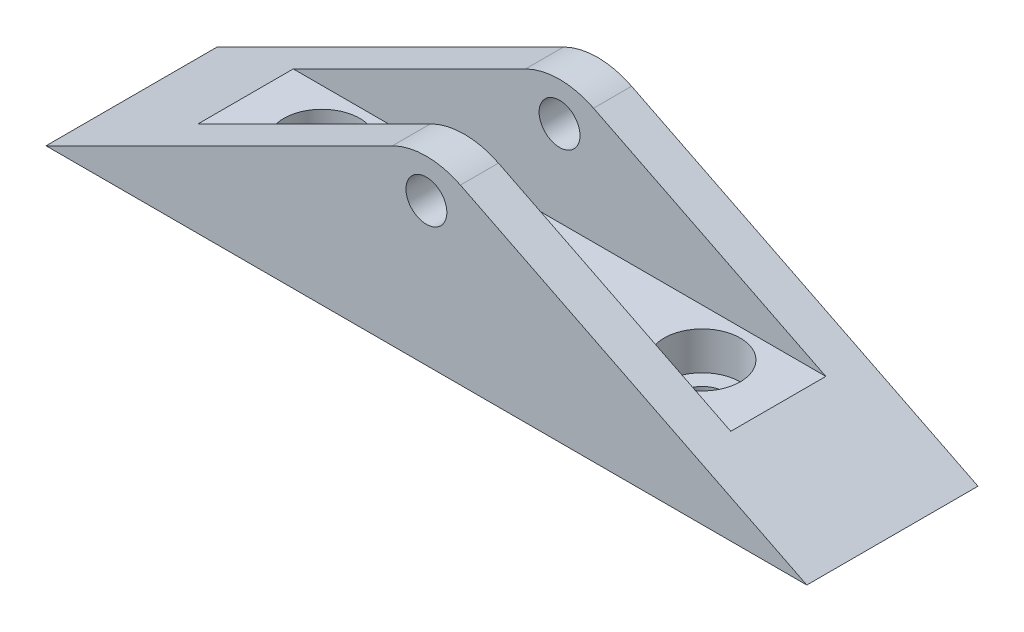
ISO-10303-21;
HEADER;
FILE_DESCRIPTION(('STEP AP214'),'2;1');
FILE_NAME('part.step','',(''),(''),'','','');
FILE_SCHEMA(('AUTOMOTIVE_DESIGN { 1 0 10303 214 1 1 1 1 }'));
ENDSEC;
DATA;
#1=APPLICATION_CONTEXT('core data for automotive mechanical design processes');
#2=APPLICATION_PROTOCOL_DEFINITION('international standard','automotive_design',2000,#1);
#3=PRODUCT_CONTEXT('',#1,'mechanical');
#4=PRODUCT('Part','Part','',(#3));
#5=PRODUCT_RELATED_PRODUCT_CATEGORY('part','',(#4));
#6=PRODUCT_DEFINITION_FORMATION('','',#4);
#7=PRODUCT_DEFINITION_CONTEXT('part definition',#1,'design');
#8=PRODUCT_DEFINITION('design','',#6,#7);
#9=PRODUCT_DEFINITION_SHAPE('','',#8);
#10=(LENGTH_UNIT() NAMED_UNIT(*) SI_UNIT(.MILLI.,.METRE.));
#11=(NAMED_UNIT(*) PLANE_ANGLE_UNIT() SI_UNIT($,.RADIAN.));
#12=(NAMED_UNIT(*) SI_UNIT($,.STERADIAN.) SOLID_ANGLE_UNIT());
#13=UNCERTAINTY_MEASURE_WITH_UNIT(LENGTH_MEASURE(1.E-05),#10,'distance_accuracy_value','');
#14=(GEOMETRIC_REPRESENTATION_CONTEXT(3) GLOBAL_UNCERTAINTY_ASSIGNED_CONTEXT((#13)) GLOBAL_UNIT_ASSIGNED_CONTEXT((#10,
#11,#12)) REPRESENTATION_CONTEXT('',''));
#15=CARTESIAN_POINT('',(0.,0.,0.));
#16=DIRECTION('',(0.,0.,1.));
#17=DIRECTION('',(1.,0.,0.));
#18=AXIS2_PLACEMENT_3D('',#15,#16,#17);
#19=CARTESIAN_POINT('',(-8.,16.,4.));
#20=DIRECTION('',(-0.447213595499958,0.894427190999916,0.));
#21=DIRECTION('',(-0.894427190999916,-0.447213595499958,0.));
#22=AXIS2_PLACEMENT_3D('',#19,#20,#21);
#23=PLANE('',#22);
#24=DIRECTION('',(0.894427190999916,0.447213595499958,0.));
#25=VECTOR('',#24,1.);
#26=CARTESIAN_POINT('',(-8.,16.,4.));
#27=LINE('',#26,#25);
#28=CARTESIAN_POINT('',(-28.,5.99999999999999,4.));
#29=VERTEX_POINT('',#28);
#30=CARTESIAN_POINT('',(-3.57770876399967,18.2111456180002,4.));
#31=VERTEX_POINT('',#30);
#32=EDGE_CURVE('E168',#29,#31,#27,.T.);
#33=ORIENTED_EDGE('',*,*,#32,.T.);
#34=DIRECTION('',(0.,0.,-1.));
#35=VECTOR('',#34,1.);
#36=CARTESIAN_POINT('',(-3.57770876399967,18.2111456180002,4.));
#37=LINE('',#36,#35);
#38=CARTESIAN_POINT('',(-3.57770876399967,18.2111456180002,0.));
#39=VERTEX_POINT('',#38);
#40=EDGE_CURVE('E186',#31,#39,#37,.T.);
#41=ORIENTED_EDGE('',*,*,#40,.T.);
#42=DIRECTION('',(0.894427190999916,0.447213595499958,0.));
#43=VECTOR('',#42,1.);
#44=CARTESIAN_POINT('',(-8.,16.,0.));
#45=LINE('',#44,#43);
#46=CARTESIAN_POINT('',(-40.,0.,0.));
#47=VERTEX_POINT('',#46);
#48=EDGE_CURVE('E129',#47,#39,#45,.T.);
#49=ORIENTED_EDGE('',*,*,#48,.F.);
#50=DIRECTION('',(0.,0.,-1.));
#51=VECTOR('',#50,1.);
#52=CARTESIAN_POINT('',(-40.,0.,104.224684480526));
#53=LINE('',#52,#51);
#54=CARTESIAN_POINT('',(-40.,0.,18.));
#55=VERTEX_POINT('',#54);
#56=EDGE_CURVE('E125',#55,#47,#53,.T.);
#57=ORIENTED_EDGE('',*,*,#56,.F.);
#58=DIRECTION('',(-0.894427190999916,-0.447213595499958,0.));
#59=VECTOR('',#58,1.);
#60=CARTESIAN_POINT('',(-8.00000000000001,16.,18.));
#61=LINE('',#60,#59);
#62=CARTESIAN_POINT('',(-3.57770876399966,18.2111456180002,18.));
#63=VERTEX_POINT('',#62);
#64=EDGE_CURVE('E112',#63,#55,#61,.T.);
#65=ORIENTED_EDGE('',*,*,#64,.F.);
#66=DIRECTION('',(0.,0.,-1.));
#67=VECTOR('',#66,1.);
#68=CARTESIAN_POINT('',(-3.57770876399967,18.2111456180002,4.));
#69=LINE('',#68,#67);
#70=CARTESIAN_POINT('',(-3.57770876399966,18.2111456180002,14.));
#71=VERTEX_POINT('',#70);
#72=EDGE_CURVE('E179',#63,#71,#69,.T.);
#73=ORIENTED_EDGE('',*,*,#72,.T.);
#74=DIRECTION('',(-0.894427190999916,-0.447213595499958,0.));
#75=VECTOR('',#74,1.);
#76=CARTESIAN_POINT('',(-8.00000000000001,16.,14.));
#77=LINE('',#76,#75);
#78=CARTESIAN_POINT('',(-28.,5.99999999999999,14.));
#79=VERTEX_POINT('',#78);
#80=EDGE_CURVE('E147',#71,#79,#77,.T.);
#81=ORIENTED_EDGE('',*,*,#80,.T.);
#82=DIRECTION('',(0.,0.,-1.));
#83=VECTOR('',#82,1.);
#84=CARTESIAN_POINT('',(-28.,5.99999999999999,104.224684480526));
#85=LINE('',#84,#83);
#86=EDGE_CURVE('E134',#79,#29,#85,.T.);
#87=ORIENTED_EDGE('',*,*,#86,.T.);
#88=EDGE_LOOP('',(#33,#41,#49,#57,#65,#73,#81,#87));
#89=FACE_BOUND('',#88,.T.);
#90=ADVANCED_FACE('F47',(#89),#23,.T.);
#91=CARTESIAN_POINT('',(8.,16.,4.));
#92=DIRECTION('',(0.447213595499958,0.894427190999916,0.));
#93=DIRECTION('',(-0.894427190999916,0.447213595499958,0.));
#94=AXIS2_PLACEMENT_3D('',#91,#92,#93);
#95=PLANE('',#94);
#96=DIRECTION('',(0.894427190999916,-0.447213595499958,0.));
#97=VECTOR('',#96,1.);
#98=CARTESIAN_POINT('',(8.,16.,0.));
#99=LINE('',#98,#97);
#100=CARTESIAN_POINT('',(3.57770876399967,18.2111456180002,0.));
#101=VERTEX_POINT('',#100);
#102=CARTESIAN_POINT('',(40.,0.,0.));
#103=VERTEX_POINT('',#102);
#104=EDGE_CURVE('E172',#101,#103,#99,.T.);
#105=ORIENTED_EDGE('',*,*,#104,.F.);
#106=DIRECTION('',(0.,0.,-1.));
#107=VECTOR('',#106,1.);
#108=CARTESIAN_POINT('',(3.57770876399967,18.2111456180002,4.));
#109=LINE('',#108,#107);
#110=CARTESIAN_POINT('',(3.57770876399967,18.2111456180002,4.));
#111=VERTEX_POINT('',#110);
#112=EDGE_CURVE('E194',#101,#111,#109,.F.);
#113=ORIENTED_EDGE('',*,*,#112,.T.);
#114=DIRECTION('',(0.894427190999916,-0.447213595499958,0.));
#115=VECTOR('',#114,1.);
#116=CARTESIAN_POINT('',(8.,16.,4.));
#117=LINE('',#116,#115);
#118=CARTESIAN_POINT('',(28.,5.99999999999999,4.));
#119=VERTEX_POINT('',#118);
#120=EDGE_CURVE('E176',#111,#119,#117,.T.);
#121=ORIENTED_EDGE('',*,*,#120,.T.);
#122=DIRECTION('',(0.,0.,-1.));
#123=VECTOR('',#122,1.);
#124=CARTESIAN_POINT('',(28.,5.99999999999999,104.224684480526));
#125=LINE('',#124,#123);
#126=CARTESIAN_POINT('',(28.,5.99999999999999,14.));
#127=VERTEX_POINT('',#126);
#128=EDGE_CURVE('E159',#127,#119,#125,.T.);
#129=ORIENTED_EDGE('',*,*,#128,.F.);
#130=DIRECTION('',(-0.894427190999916,0.447213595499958,0.));
#131=VECTOR('',#130,1.);
#132=CARTESIAN_POINT('',(8.00000000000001,16.,14.));
#133=LINE('',#132,#131);
#134=CARTESIAN_POINT('',(3.57770876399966,18.2111456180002,14.));
#135=VERTEX_POINT('',#134);
#136=EDGE_CURVE('E122',#127,#135,#133,.T.);
#137=ORIENTED_EDGE('',*,*,#136,.T.);
#138=DIRECTION('',(0.,0.,-1.));
#139=VECTOR('',#138,1.);
#140=CARTESIAN_POINT('',(3.57770876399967,18.2111456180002,4.));
#141=LINE('',#140,#139);
#142=CARTESIAN_POINT('',(3.57770876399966,18.2111456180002,18.));
#143=VERTEX_POINT('',#142);
#144=EDGE_CURVE('E63',#135,#143,#141,.F.);
#145=ORIENTED_EDGE('',*,*,#144,.T.);
#146=DIRECTION('',(-0.894427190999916,0.447213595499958,0.));
#147=VECTOR('',#146,1.);
#148=CARTESIAN_POINT('',(8.00000000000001,16.,18.));
#149=LINE('',#148,#147);
#150=CARTESIAN_POINT('',(40.,0.,18.));
#151=VERTEX_POINT('',#150);
#152=EDGE_CURVE('E140',#151,#143,#149,.T.);
#153=ORIENTED_EDGE('',*,*,#152,.F.);
#154=DIRECTION('',(0.,0.,-1.));
#155=VECTOR('',#154,1.);
#156=CARTESIAN_POINT('',(40.,0.,104.224684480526));
#157=LINE('',#156,#155);
#158=EDGE_CURVE('E135',#151,#103,#157,.T.);
#159=ORIENTED_EDGE('',*,*,#158,.T.);
#160=EDGE_LOOP('',(#105,#113,#121,#129,#137,#145,#153,#159));
#161=FACE_BOUND('',#160,.T.);
#162=ADVANCED_FACE('F213',(#161),#95,.T.);
#163=CARTESIAN_POINT('',(0.,0.,4.));
#164=DIRECTION('',(0.,0.,1.));
#165=DIRECTION('',(1.,0.,0.));
#166=AXIS2_PLACEMENT_3D('',#163,#164,#165);
#167=PLANE('',#166);
#168=CARTESIAN_POINT('',(0.,15.,4.));
#169=DIRECTION('',(0.,0.,1.));
#170=DIRECTION('',(1.,0.,0.));
#171=AXIS2_PLACEMENT_3D('',#168,#169,#170);
#172=CIRCLE('',#171,2.15);
#173=CARTESIAN_POINT('',(2.15,15.,4.));
#174=VERTEX_POINT('',#173);
#175=EDGE_CURVE('E150',#174,#174,#172,.T.);
#176=ORIENTED_EDGE('',*,*,#175,.F.);
#177=EDGE_LOOP('',(#176));
#178=FACE_BOUND('',#177,.T.);
#179=ORIENTED_EDGE('',*,*,#120,.F.);
#180=CARTESIAN_POINT('',(0.,11.0557280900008,4.));
#181=DIRECTION('',(0.,0.,1.));
#182=DIRECTION('',(1.,0.,0.));
#183=AXIS2_PLACEMENT_3D('',#180,#181,#182);
#184=CIRCLE('',#183,8.);
#185=EDGE_CURVE('E197',#111,#31,#184,.T.);
#186=ORIENTED_EDGE('',*,*,#185,.T.);
#187=ORIENTED_EDGE('',*,*,#32,.F.);
#188=DIRECTION('',(1.,0.,0.));
#189=VECTOR('',#188,1.);
#190=CARTESIAN_POINT('',(0.,5.99999999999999,4.));
#191=LINE('',#190,#189);
#192=EDGE_CURVE('E171',#29,#119,#191,.T.);
#193=ORIENTED_EDGE('',*,*,#192,.T.);
#194=EDGE_LOOP('',(#179,#186,#187,#193));
#195=FACE_BOUND('',#194,.T.);
#196=ADVANCED_FACE('F204',(#178,#195),#167,.T.);
#197=CARTESIAN_POINT('',(0.,0.,0.));
#198=DIRECTION('',(0.,0.,1.));
#199=DIRECTION('',(1.,0.,0.));
#200=AXIS2_PLACEMENT_3D('',#197,#198,#199);
#201=PLANE('',#200);
#202=CARTESIAN_POINT('',(0.,15.,0.));
#203=DIRECTION('',(0.,0.,-1.));
#204=DIRECTION('',(-1.,0.,0.));
#205=AXIS2_PLACEMENT_3D('',#202,#203,#204);
#206=CIRCLE('',#205,2.15);
#207=CARTESIAN_POINT('',(-2.15,15.,0.));
#208=VERTEX_POINT('',#207);
#209=EDGE_CURVE('E274',#208,#208,#206,.T.);
#210=ORIENTED_EDGE('',*,*,#209,.F.);
#211=EDGE_LOOP('',(#210));
#212=FACE_BOUND('',#211,.T.);
#213=ORIENTED_EDGE('',*,*,#48,.T.);
#214=CARTESIAN_POINT('',(0.,11.0557280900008,0.));
#215=DIRECTION('',(0.,0.,1.));
#216=DIRECTION('',(1.,0.,0.));
#217=AXIS2_PLACEMENT_3D('',#214,#215,#216);
#218=CIRCLE('',#217,8.);
#219=EDGE_CURVE('E189',#39,#101,#218,.F.);
#220=ORIENTED_EDGE('',*,*,#219,.T.);
#221=ORIENTED_EDGE('',*,*,#104,.T.);
#222=DIRECTION('',(-1.,0.,0.));
#223=VECTOR('',#222,1.);
#224=CARTESIAN_POINT('',(0.,0.,0.));
#225=LINE('',#224,#223);
#226=EDGE_CURVE('E143',#103,#47,#225,.T.);
#227=ORIENTED_EDGE('',*,*,#226,.T.);
#228=EDGE_LOOP('',(#213,#220,#221,#227));
#229=FACE_BOUND('',#228,.T.);
#230=ADVANCED_FACE('F212',(#212,#229),#201,.F.);
#231=CARTESIAN_POINT('',(0.,5.99999999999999,104.224684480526));
#232=DIRECTION('',(0.,1.,0.));
#233=DIRECTION('',(0.,0.,1.));
#234=AXIS2_PLACEMENT_3D('',#231,#232,#233);
#235=PLANE('',#234);
#236=CARTESIAN_POINT('',(-20.,5.99999999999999,9.));
#237=DIRECTION('',(0.,1.,0.));
#238=DIRECTION('',(0.,0.,1.));
#239=AXIS2_PLACEMENT_3D('',#236,#237,#238);
#240=CIRCLE('',#239,4.);
#241=CARTESIAN_POINT('',(-20.,5.99999999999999,13.));
#242=VERTEX_POINT('',#241);
#243=EDGE_CURVE('E308',#242,#242,#240,.T.);
#244=ORIENTED_EDGE('',*,*,#243,.F.);
#245=EDGE_LOOP('',(#244));
#246=FACE_BOUND('',#245,.T.);
#247=CARTESIAN_POINT('',(20.,5.99999999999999,9.));
#248=DIRECTION('',(0.,1.,0.));
#249=DIRECTION('',(0.,0.,1.));
#250=AXIS2_PLACEMENT_3D('',#247,#248,#249);
#251=CIRCLE('',#250,4.);
#252=CARTESIAN_POINT('',(20.,5.99999999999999,13.));
#253=VERTEX_POINT('',#252);
#254=EDGE_CURVE('E292',#253,#253,#251,.T.);
#255=ORIENTED_EDGE('',*,*,#254,.F.);
#256=EDGE_LOOP('',(#255));
#257=FACE_BOUND('',#256,.T.);
#258=ORIENTED_EDGE('',*,*,#192,.F.);
#259=ORIENTED_EDGE('',*,*,#86,.F.);
#260=DIRECTION('',(1.,0.,0.));
#261=VECTOR('',#260,1.);
#262=CARTESIAN_POINT('',(0.,5.99999999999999,14.));
#263=LINE('',#262,#261);
#264=EDGE_CURVE('E155',#79,#127,#263,.T.);
#265=ORIENTED_EDGE('',*,*,#264,.T.);
#266=ORIENTED_EDGE('',*,*,#128,.T.);
#267=EDGE_LOOP('',(#258,#259,#265,#266));
#268=FACE_BOUND('',#267,.T.);
#269=ADVANCED_FACE('F219',(#246,#257,#268),#235,.T.);
#270=CARTESIAN_POINT('',(0.,0.,104.224684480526));
#271=DIRECTION('',(0.,-1.,0.));
#272=DIRECTION('',(0.,0.,-1.));
#273=AXIS2_PLACEMENT_3D('',#270,#271,#272);
#274=PLANE('',#273);
#275=CARTESIAN_POINT('',(-20.,0.,9.));
#276=DIRECTION('',(0.,1.,0.));
#277=DIRECTION('',(0.,0.,1.));
#278=AXIS2_PLACEMENT_3D('',#275,#276,#277);
#279=CIRCLE('',#278,2.25);
#280=CARTESIAN_POINT('',(-20.,0.,11.25));
#281=VERTEX_POINT('',#280);
#282=EDGE_CURVE('E296',#281,#281,#279,.T.);
#283=ORIENTED_EDGE('',*,*,#282,.T.);
#284=EDGE_LOOP('',(#283));
#285=FACE_BOUND('',#284,.T.);
#286=CARTESIAN_POINT('',(20.,0.,9.));
#287=DIRECTION('',(0.,1.,0.));
#288=DIRECTION('',(0.,0.,1.));
#289=AXIS2_PLACEMENT_3D('',#286,#287,#288);
#290=CIRCLE('',#289,2.25);
#291=CARTESIAN_POINT('',(20.,0.,11.25));
#292=VERTEX_POINT('',#291);
#293=EDGE_CURVE('E280',#292,#292,#290,.T.);
#294=ORIENTED_EDGE('',*,*,#293,.T.);
#295=EDGE_LOOP('',(#294));
#296=FACE_BOUND('',#295,.T.);
#297=ORIENTED_EDGE('',*,*,#158,.F.);
#298=DIRECTION('',(1.,0.,0.));
#299=VECTOR('',#298,1.);
#300=CARTESIAN_POINT('',(0.,0.,18.));
#301=LINE('',#300,#299);
#302=EDGE_CURVE('E116',#55,#151,#301,.T.);
#303=ORIENTED_EDGE('',*,*,#302,.F.);
#304=ORIENTED_EDGE('',*,*,#56,.T.);
#305=ORIENTED_EDGE('',*,*,#226,.F.);
#306=EDGE_LOOP('',(#297,#303,#304,#305));
#307=FACE_BOUND('',#306,.T.);
#308=ADVANCED_FACE('F137',(#285,#296,#307),#274,.T.);
#309=CARTESIAN_POINT('',(0.,0.,14.));
#310=DIRECTION('',(0.,0.,-1.));
#311=DIRECTION('',(-1.,0.,0.));
#312=AXIS2_PLACEMENT_3D('',#309,#310,#311);
#313=PLANE('',#312);
#314=CARTESIAN_POINT('',(0.,15.,14.));
#315=DIRECTION('',(0.,0.,-1.));
#316=DIRECTION('',(-1.,0.,0.));
#317=AXIS2_PLACEMENT_3D('',#314,#315,#316);
#318=CIRCLE('',#317,2.15);
#319=CARTESIAN_POINT('',(-2.15,15.,14.));
#320=VERTEX_POINT('',#319);
#321=EDGE_CURVE('E267',#320,#320,#318,.T.);
#322=ORIENTED_EDGE('',*,*,#321,.F.);
#323=EDGE_LOOP('',(#322));
#324=FACE_BOUND('',#323,.T.);
#325=ORIENTED_EDGE('',*,*,#80,.F.);
#326=CARTESIAN_POINT('',(0.,11.0557280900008,14.));
#327=DIRECTION('',(0.,0.,-1.));
#328=DIRECTION('',(-1.,0.,0.));
#329=AXIS2_PLACEMENT_3D('',#326,#327,#328);
#330=CIRCLE('',#329,8.);
#331=EDGE_CURVE('E56',#71,#135,#330,.T.);
#332=ORIENTED_EDGE('',*,*,#331,.T.);
#333=ORIENTED_EDGE('',*,*,#136,.F.);
#334=ORIENTED_EDGE('',*,*,#264,.F.);
#335=EDGE_LOOP('',(#325,#332,#333,#334));
#336=FACE_BOUND('',#335,.T.);
#337=ADVANCED_FACE('F216',(#324,#336),#313,.T.);
#338=CARTESIAN_POINT('',(0.,0.,18.));
#339=DIRECTION('',(0.,0.,-1.));
#340=DIRECTION('',(-1.,0.,0.));
#341=AXIS2_PLACEMENT_3D('',#338,#339,#340);
#342=PLANE('',#341);
#343=CARTESIAN_POINT('',(0.,15.,18.));
#344=DIRECTION('',(0.,0.,-1.));
#345=DIRECTION('',(-1.,0.,0.));
#346=AXIS2_PLACEMENT_3D('',#343,#344,#345);
#347=CIRCLE('',#346,2.15);
#348=CARTESIAN_POINT('',(-2.15,15.,18.));
#349=VERTEX_POINT('',#348);
#350=EDGE_CURVE('E269',#349,#349,#347,.T.);
#351=ORIENTED_EDGE('',*,*,#350,.T.);
#352=EDGE_LOOP('',(#351));
#353=FACE_BOUND('',#352,.T.);
#354=ORIENTED_EDGE('',*,*,#152,.T.);
#355=CARTESIAN_POINT('',(0.,11.0557280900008,18.));
#356=DIRECTION('',(0.,0.,-1.));
#357=DIRECTION('',(-1.,0.,0.));
#358=AXIS2_PLACEMENT_3D('',#355,#356,#357);
#359=CIRCLE('',#358,8.);
#360=EDGE_CURVE('E12',#143,#63,#359,.F.);
#361=ORIENTED_EDGE('',*,*,#360,.T.);
#362=ORIENTED_EDGE('',*,*,#64,.T.);
#363=ORIENTED_EDGE('',*,*,#302,.T.);
#364=EDGE_LOOP('',(#354,#361,#362,#363));
#365=FACE_BOUND('',#364,.T.);
#366=ADVANCED_FACE('F114',(#353,#365),#342,.F.);
#367=CARTESIAN_POINT('',(0.,15.,0.));
#368=DIRECTION('',(0.,0.,-1.));
#369=DIRECTION('',(-1.,0.,0.));
#370=AXIS2_PLACEMENT_3D('',#367,#368,#369);
#371=CYLINDRICAL_SURFACE('',#370,2.15);
#372=ORIENTED_EDGE('',*,*,#321,.T.);
#373=EDGE_LOOP('',(#372));
#374=FACE_BOUND('',#373,.T.);
#375=ORIENTED_EDGE('',*,*,#350,.F.);
#376=EDGE_LOOP('',(#375));
#377=FACE_BOUND('',#376,.T.);
#378=ADVANCED_FACE('F247',(#374,#377),#371,.F.);
#379=ORIENTED_EDGE('',*,*,#175,.T.);
#380=EDGE_LOOP('',(#379));
#381=FACE_BOUND('',#380,.T.);
#382=ORIENTED_EDGE('',*,*,#209,.T.);
#383=EDGE_LOOP('',(#382));
#384=FACE_BOUND('',#383,.T.);
#385=ADVANCED_FACE('F241',(#381,#384),#371,.F.);
#386=CARTESIAN_POINT('',(0.,11.0557280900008,4.));
#387=DIRECTION('',(0.,0.,-1.));
#388=DIRECTION('',(-1.,0.,0.));
#389=AXIS2_PLACEMENT_3D('',#386,#387,#388);
#390=CYLINDRICAL_SURFACE('',#389,8.);
#391=ORIENTED_EDGE('',*,*,#185,.F.);
#392=ORIENTED_EDGE('',*,*,#112,.F.);
#393=ORIENTED_EDGE('',*,*,#219,.F.);
#394=ORIENTED_EDGE('',*,*,#40,.F.);
#395=EDGE_LOOP('',(#391,#392,#393,#394));
#396=FACE_BOUND('',#395,.T.);
#397=ADVANCED_FACE('F209',(#396),#390,.T.);
#398=CARTESIAN_POINT('',(0.,11.0557280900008,4.));
#399=DIRECTION('',(0.,0.,-1.));
#400=DIRECTION('',(-1.,0.,0.));
#401=AXIS2_PLACEMENT_3D('',#398,#399,#400);
#402=CYLINDRICAL_SURFACE('',#401,8.);
#403=ORIENTED_EDGE('',*,*,#360,.F.);
#404=ORIENTED_EDGE('',*,*,#144,.F.);
#405=ORIENTED_EDGE('',*,*,#331,.F.);
#406=ORIENTED_EDGE('',*,*,#72,.F.);
#407=EDGE_LOOP('',(#403,#404,#405,#406));
#408=FACE_BOUND('',#407,.T.);
#409=ADVANCED_FACE('F49',(#408),#402,.T.);
#410=CARTESIAN_POINT('',(20.,5.99999999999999,9.));
#411=DIRECTION('',(0.,1.,0.));
#412=DIRECTION('',(0.,0.,1.));
#413=AXIS2_PLACEMENT_3D('',#410,#411,#412);
#414=CYLINDRICAL_SURFACE('',#413,2.25);
#415=ORIENTED_EDGE('',*,*,#293,.F.);
#416=EDGE_LOOP('',(#415));
#417=FACE_BOUND('',#416,.T.);
#418=CARTESIAN_POINT('',(20.,1.99999999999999,9.));
#419=DIRECTION('',(0.,1.,0.));
#420=DIRECTION('',(0.,0.,1.));
#421=AXIS2_PLACEMENT_3D('',#418,#419,#420);
#422=CIRCLE('',#421,2.25);
#423=CARTESIAN_POINT('',(20.,1.99999999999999,11.25));
#424=VERTEX_POINT('',#423);
#425=EDGE_CURVE('E284',#424,#424,#422,.T.);
#426=ORIENTED_EDGE('',*,*,#425,.T.);
#427=EDGE_LOOP('',(#426));
#428=FACE_BOUND('',#427,.T.);
#429=ADVANCED_FACE('F246',(#417,#428),#414,.F.);
#430=CARTESIAN_POINT('',(22.25,1.99999999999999,9.));
#431=DIRECTION('',(0.,-1.,0.));
#432=DIRECTION('',(0.,0.,-1.));
#433=AXIS2_PLACEMENT_3D('',#430,#431,#432);
#434=PLANE('',#433);
#435=ORIENTED_EDGE('',*,*,#425,.F.);
#436=EDGE_LOOP('',(#435));
#437=FACE_BOUND('',#436,.T.);
#438=CARTESIAN_POINT('',(20.,1.99999999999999,9.));
#439=DIRECTION('',(0.,1.,0.));
#440=DIRECTION('',(0.,0.,1.));
#441=AXIS2_PLACEMENT_3D('',#438,#439,#440);
#442=CIRCLE('',#441,4.);
#443=CARTESIAN_POINT('',(20.,1.99999999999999,13.));
#444=VERTEX_POINT('',#443);
#445=EDGE_CURVE('E288',#444,#444,#442,.T.);
#446=ORIENTED_EDGE('',*,*,#445,.T.);
#447=EDGE_LOOP('',(#446));
#448=FACE_BOUND('',#447,.T.);
#449=ADVANCED_FACE('F330',(#437,#448),#434,.F.);
#450=CARTESIAN_POINT('',(20.,5.99999999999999,9.));
#451=DIRECTION('',(0.,1.,0.));
#452=DIRECTION('',(0.,0.,1.));
#453=AXIS2_PLACEMENT_3D('',#450,#451,#452);
#454=CYLINDRICAL_SURFACE('',#453,4.);
#455=ORIENTED_EDGE('',*,*,#445,.F.);
#456=EDGE_LOOP('',(#455));
#457=FACE_BOUND('',#456,.T.);
#458=ORIENTED_EDGE('',*,*,#254,.T.);
#459=EDGE_LOOP('',(#458));
#460=FACE_BOUND('',#459,.T.);
#461=ADVANCED_FACE('F327',(#457,#460),#454,.F.);
#462=CARTESIAN_POINT('',(-20.,5.99999999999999,9.));
#463=DIRECTION('',(0.,1.,0.));
#464=DIRECTION('',(0.,0.,1.));
#465=AXIS2_PLACEMENT_3D('',#462,#463,#464);
#466=CYLINDRICAL_SURFACE('',#465,2.25);
#467=ORIENTED_EDGE('',*,*,#282,.F.);
#468=EDGE_LOOP('',(#467));
#469=FACE_BOUND('',#468,.T.);
#470=CARTESIAN_POINT('',(-20.,1.99999999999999,9.));
#471=DIRECTION('',(0.,1.,0.));
#472=DIRECTION('',(0.,0.,1.));
#473=AXIS2_PLACEMENT_3D('',#470,#471,#472);
#474=CIRCLE('',#473,2.25);
#475=CARTESIAN_POINT('',(-20.,1.99999999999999,11.25));
#476=VERTEX_POINT('',#475);
#477=EDGE_CURVE('E300',#476,#476,#474,.T.);
#478=ORIENTED_EDGE('',*,*,#477,.T.);
#479=EDGE_LOOP('',(#478));
#480=FACE_BOUND('',#479,.T.);
#481=ADVANCED_FACE('F320',(#469,#480),#466,.F.);
#482=CARTESIAN_POINT('',(-17.75,1.99999999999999,9.));
#483=DIRECTION('',(0.,-1.,0.));
#484=DIRECTION('',(0.,0.,-1.));
#485=AXIS2_PLACEMENT_3D('',#482,#483,#484);
#486=PLANE('',#485);
#487=ORIENTED_EDGE('',*,*,#477,.F.);
#488=EDGE_LOOP('',(#487));
#489=FACE_BOUND('',#488,.T.);
#490=CARTESIAN_POINT('',(-20.,1.99999999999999,9.));
#491=DIRECTION('',(0.,1.,0.));
#492=DIRECTION('',(0.,0.,1.));
#493=AXIS2_PLACEMENT_3D('',#490,#491,#492);
#494=CIRCLE('',#493,4.);
#495=CARTESIAN_POINT('',(-20.,1.99999999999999,13.));
#496=VERTEX_POINT('',#495);
#497=EDGE_CURVE('E304',#496,#496,#494,.T.);
#498=ORIENTED_EDGE('',*,*,#497,.T.);
#499=EDGE_LOOP('',(#498));
#500=FACE_BOUND('',#499,.T.);
#501=ADVANCED_FACE('F314',(#489,#500),#486,.F.);
#502=CARTESIAN_POINT('',(-20.,5.99999999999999,9.));
#503=DIRECTION('',(0.,1.,0.));
#504=DIRECTION('',(0.,0.,1.));
#505=AXIS2_PLACEMENT_3D('',#502,#503,#504);
#506=CYLINDRICAL_SURFACE('',#505,4.);
#507=ORIENTED_EDGE('',*,*,#497,.F.);
#508=EDGE_LOOP('',(#507));
#509=FACE_BOUND('',#508,.T.);
#510=ORIENTED_EDGE('',*,*,#243,.T.);
#511=EDGE_LOOP('',(#510));
#512=FACE_BOUND('',#511,.T.);
#513=ADVANCED_FACE('F312',(#509,#512),#506,.F.);
#514=CLOSED_SHELL('',(#90,#162,#196,#230,#269,#308,#337,#366,#378,#385,#397,#409,#429,#449,#461,
#481,#501,#513));
#515=MANIFOLD_SOLID_BREP('B2',#514);
#516=ADVANCED_BREP_SHAPE_REPRESENTATION('',(#18,#515),#14);
#517=SHAPE_DEFINITION_REPRESENTATION(#9,#516);
ENDSEC;
END-ISO-10303-21;
